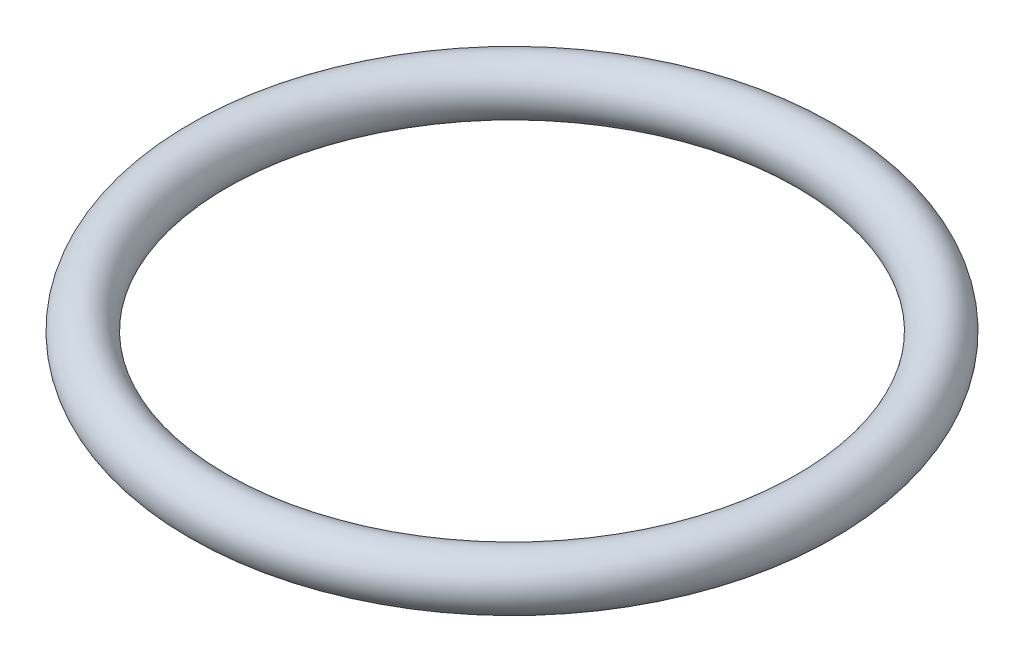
from build123d import *

# Parameters (mm, degrees)
ESQUISSE1_R = 1.5


with BuildPart() as part:
    # Esquisse1 → Base-R_volution (revolve)
    with BuildSketch(Plane.XY, mode=Mode.PRIVATE) as base_r_volution_sk:
        with Locations((17.5, 0)):
            Circle(ESQUISSE1_R)
    revolve(base_r_volution_sk.sketch.rotate(Axis((0, 18.852901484, 0), (0, -1, 0)), 90), axis=Axis((0, 18.852901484, 0), (0, -1, 0)))


solid = part.part
